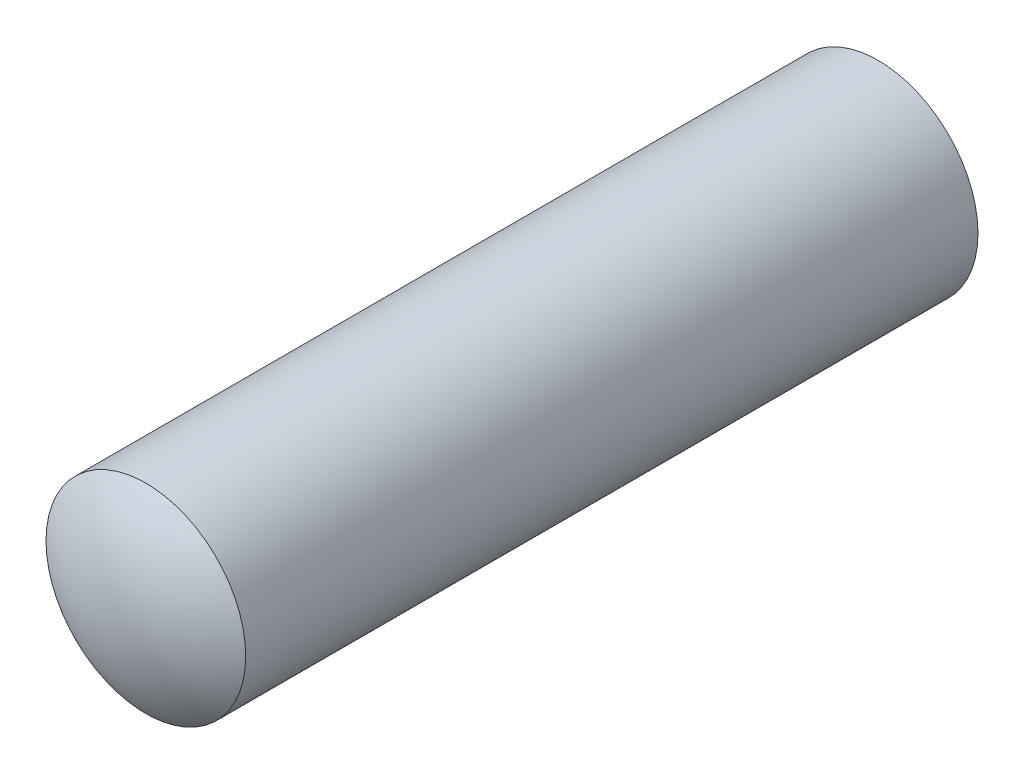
ISO-10303-21;
HEADER;
FILE_DESCRIPTION(('STEP AP214'),'2;1');
FILE_NAME('part.step','',(''),(''),'','','');
FILE_SCHEMA(('AUTOMOTIVE_DESIGN { 1 0 10303 214 1 1 1 1 }'));
ENDSEC;
DATA;
#1=APPLICATION_CONTEXT('core data for automotive mechanical design processes');
#2=APPLICATION_PROTOCOL_DEFINITION('international standard','automotive_design',2000,#1);
#3=PRODUCT_CONTEXT('',#1,'mechanical');
#4=PRODUCT('Part','Part','',(#3));
#5=PRODUCT_RELATED_PRODUCT_CATEGORY('part','',(#4));
#6=PRODUCT_DEFINITION_FORMATION('','',#4);
#7=PRODUCT_DEFINITION_CONTEXT('part definition',#1,'design');
#8=PRODUCT_DEFINITION('design','',#6,#7);
#9=PRODUCT_DEFINITION_SHAPE('','',#8);
#10=(LENGTH_UNIT() NAMED_UNIT(*) SI_UNIT(.MILLI.,.METRE.));
#11=(NAMED_UNIT(*) PLANE_ANGLE_UNIT() SI_UNIT($,.RADIAN.));
#12=(NAMED_UNIT(*) SI_UNIT($,.STERADIAN.) SOLID_ANGLE_UNIT());
#13=UNCERTAINTY_MEASURE_WITH_UNIT(LENGTH_MEASURE(1.E-05),#10,'distance_accuracy_value','');
#14=(GEOMETRIC_REPRESENTATION_CONTEXT(3) GLOBAL_UNCERTAINTY_ASSIGNED_CONTEXT((#13)) GLOBAL_UNIT_ASSIGNED_CONTEXT((#10,
#11,#12)) REPRESENTATION_CONTEXT('',''));
#15=CARTESIAN_POINT('',(0.,0.,0.));
#16=DIRECTION('',(0.,0.,1.));
#17=DIRECTION('',(1.,0.,0.));
#18=AXIS2_PLACEMENT_3D('',#15,#16,#17);
#19=CARTESIAN_POINT('',(0.,0.,11.));
#20=DIRECTION('',(0.,0.,-0.999999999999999));
#21=DIRECTION('',(-1.,0.,0.));
#22=AXIS2_PLACEMENT_3D('',#19,#20,#21);
#23=CYLINDRICAL_SURFACE('',#22,1.5);
#24=CARTESIAN_POINT('',(0.,0.,11.));
#25=DIRECTION('',(0.,0.,0.999999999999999));
#26=DIRECTION('',(1.,0.,0.));
#27=AXIS2_PLACEMENT_3D('',#24,#25,#26);
#28=CIRCLE('',#27,1.5);
#29=CARTESIAN_POINT('',(-1.49999999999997,0.,11.));
#30=VERTEX_POINT('',#29);
#31=EDGE_CURVE('E10',#30,#30,#28,.T.);
#32=CARTESIAN_POINT('',(0.,0.,0.));
#33=DIRECTION('',(0.,0.,0.999999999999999));
#34=DIRECTION('',(1.,0.,0.));
#35=AXIS2_PLACEMENT_3D('',#32,#33,#34);
#36=CIRCLE('',#35,1.5);
#37=CARTESIAN_POINT('',(-1.49999999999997,0.,0.));
#38=VERTEX_POINT('',#37);
#39=EDGE_CURVE('E33',#38,#38,#36,.T.);
#40=CARTESIAN_POINT('',(-1.49999999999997,0.,11.));
#41=CARTESIAN_POINT('',(-1.49999999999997,0.,10.8854166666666));
#42=CARTESIAN_POINT('',(-1.49999999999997,0.,10.7708333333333));
#43=CARTESIAN_POINT('',(-1.49999999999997,0.,10.5416666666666));
#44=CARTESIAN_POINT('',(-1.49999999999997,0.,10.4270833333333));
#45=CARTESIAN_POINT('',(-1.49999999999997,0.,10.1979166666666));
#46=CARTESIAN_POINT('',(-1.49999999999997,0.,10.0833333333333));
#47=CARTESIAN_POINT('',(-1.49999999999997,0.,9.85416666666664));
#48=CARTESIAN_POINT('',(-1.49999999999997,0.,9.7395833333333));
#49=CARTESIAN_POINT('',(-1.49999999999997,0.,9.51041666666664));
#50=CARTESIAN_POINT('',(-1.49999999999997,0.,9.39583333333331));
#51=CARTESIAN_POINT('',(-1.49999999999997,0.,9.16666666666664));
#52=CARTESIAN_POINT('',(-1.49999999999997,0.,9.05208333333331));
#53=CARTESIAN_POINT('',(-1.49999999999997,0.,8.82291666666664));
#54=CARTESIAN_POINT('',(-1.49999999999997,0.,8.70833333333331));
#55=CARTESIAN_POINT('',(-1.49999999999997,0.,8.47916666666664));
#56=CARTESIAN_POINT('',(-1.49999999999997,0.,8.36458333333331));
#57=CARTESIAN_POINT('',(-1.49999999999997,0.,8.13541666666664));
#58=CARTESIAN_POINT('',(-1.49999999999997,0.,8.02083333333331));
#59=CARTESIAN_POINT('',(-1.49999999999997,0.,7.79166666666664));
#60=CARTESIAN_POINT('',(-1.49999999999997,0.,7.67708333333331));
#61=CARTESIAN_POINT('',(-1.49999999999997,0.,7.44791666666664));
#62=CARTESIAN_POINT('',(-1.49999999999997,0.,7.33333333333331));
#63=CARTESIAN_POINT('',(-1.49999999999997,0.,7.10416666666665));
#64=CARTESIAN_POINT('',(-1.49999999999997,0.,6.98958333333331));
#65=CARTESIAN_POINT('',(-1.49999999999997,0.,6.76041666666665));
#66=CARTESIAN_POINT('',(-1.49999999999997,0.,6.64583333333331));
#67=CARTESIAN_POINT('',(-1.49999999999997,0.,6.41666666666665));
#68=CARTESIAN_POINT('',(-1.49999999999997,0.,6.30208333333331));
#69=CARTESIAN_POINT('',(-1.49999999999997,0.,6.07291666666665));
#70=CARTESIAN_POINT('',(-1.49999999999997,0.,5.95833333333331));
#71=CARTESIAN_POINT('',(-1.49999999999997,0.,5.72916666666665));
#72=CARTESIAN_POINT('',(-1.49999999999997,0.,5.61458333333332));
#73=CARTESIAN_POINT('',(-1.49999999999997,0.,5.38541666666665));
#74=CARTESIAN_POINT('',(-1.49999999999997,0.,5.27083333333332));
#75=CARTESIAN_POINT('',(-1.49999999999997,0.,5.04166666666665));
#76=CARTESIAN_POINT('',(-1.49999999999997,0.,4.92708333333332));
#77=CARTESIAN_POINT('',(-1.49999999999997,0.,4.69791666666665));
#78=CARTESIAN_POINT('',(-1.49999999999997,0.,4.58333333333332));
#79=CARTESIAN_POINT('',(-1.49999999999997,0.,4.35416666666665));
#80=CARTESIAN_POINT('',(-1.49999999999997,0.,4.23958333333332));
#81=CARTESIAN_POINT('',(-1.49999999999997,0.,4.01041666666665));
#82=CARTESIAN_POINT('',(-1.49999999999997,0.,3.89583333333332));
#83=CARTESIAN_POINT('',(-1.49999999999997,0.,3.66666666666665));
#84=CARTESIAN_POINT('',(-1.49999999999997,0.,3.55208333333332));
#85=CARTESIAN_POINT('',(-1.49999999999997,0.,3.32291666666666));
#86=CARTESIAN_POINT('',(-1.49999999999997,0.,3.20833333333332));
#87=CARTESIAN_POINT('',(-1.49999999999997,0.,2.97916666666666));
#88=CARTESIAN_POINT('',(-1.49999999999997,0.,2.86458333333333));
#89=CARTESIAN_POINT('',(-1.49999999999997,0.,2.63541666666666));
#90=CARTESIAN_POINT('',(-1.49999999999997,0.,2.52083333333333));
#91=CARTESIAN_POINT('',(-1.49999999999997,0.,2.29166666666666));
#92=CARTESIAN_POINT('',(-1.49999999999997,0.,2.17708333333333));
#93=CARTESIAN_POINT('',(-1.49999999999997,0.,1.94791666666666));
#94=CARTESIAN_POINT('',(-1.49999999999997,0.,1.83333333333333));
#95=CARTESIAN_POINT('',(-1.49999999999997,0.,1.60416666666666));
#96=CARTESIAN_POINT('',(-1.49999999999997,0.,1.48958333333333));
#97=CARTESIAN_POINT('',(-1.49999999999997,0.,1.26041666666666));
#98=CARTESIAN_POINT('',(-1.49999999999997,0.,1.14583333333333));
#99=CARTESIAN_POINT('',(-1.49999999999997,0.,0.916666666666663));
#100=CARTESIAN_POINT('',(-1.49999999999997,0.,0.80208333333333));
#101=CARTESIAN_POINT('',(-1.49999999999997,0.,0.572916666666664));
#102=CARTESIAN_POINT('',(-1.49999999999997,0.,0.45833333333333));
#103=CARTESIAN_POINT('',(-1.49999999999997,0.,0.229166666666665));
#104=CARTESIAN_POINT('',(-1.49999999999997,0.,0.114583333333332));
#105=CARTESIAN_POINT('',(-1.49999999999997,0.,0.));
#106=B_SPLINE_CURVE_WITH_KNOTS('',3,(#40,#41,#42,#43,#44,#45,#46,#47,#48,#49,#50,#51,#52,#53,
#54,#55,#56,#57,#58,#59,#60,#61,#62,#63,#64,#65,#66,#67,#68,#69,#70,#71,#72,#73,#74,#75,#76,#77,
#78,#79,#80,#81,#82,#83,#84,#85,#86,#87,#88,#89,#90,#91,#92,#93,#94,#95,#96,#97,#98,#99,#100,
#101,#102,#103,#104,#105),.UNSPECIFIED.,.F.,.F.,(4,2,2,2,2,2,2,2,2,2,2,2,2,2,2,2,2,2,2,2,2,2,2,
2,2,2,2,2,2,2,2,2,4),(0.,0.34375,0.687499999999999,1.03125,1.375,1.71875,2.06249999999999,
2.40624999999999,2.74999999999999,3.09374999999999,3.43749999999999,3.78124999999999,
4.12499999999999,4.46874999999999,4.81249999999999,5.15624999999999,5.49999999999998,
5.84374999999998,6.18749999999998,6.53124999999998,6.87499999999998,7.21874999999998,
7.56249999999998,7.90624999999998,8.24999999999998,8.59374999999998,8.93749999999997,
9.28124999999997,9.62499999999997,9.96874999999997,10.3125,10.65625,11.),.UNSPECIFIED.);
#107=EDGE_CURVE('BSEAM26',#30,#38,#106,.T.);
#108=ORIENTED_EDGE('',*,*,#31,.F.);
#109=ORIENTED_EDGE('',*,*,#39,.T.);
#110=ORIENTED_EDGE('',*,*,#107,.T.);
#111=ORIENTED_EDGE('',*,*,#107,.F.);
#112=EDGE_LOOP('',(#108,#110,#109,#111));
#113=FACE_BOUND('',#112,.T.);
#114=ADVANCED_FACE('F26',(#113),#23,.T.);
#115=CARTESIAN_POINT('',(0.,0.,8.99999999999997));
#116=DIRECTION('',(0.,0.,0.999999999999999));
#117=DIRECTION('',(1.,0.,0.));
#118=AXIS2_PLACEMENT_3D('',#115,#116,#117);
#119=SPHERICAL_SURFACE('',#118,2.5);
#120=ORIENTED_EDGE('',*,*,#31,.T.);
#121=EDGE_LOOP('',(#120));
#122=FACE_BOUND('',#121,.T.);
#123=ADVANCED_FACE('F41',(#122),#119,.T.);
#124=CARTESIAN_POINT('',(0.,0.,2.));
#125=DIRECTION('',(0.,0.,0.999999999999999));
#126=DIRECTION('',(1.,0.,0.));
#127=AXIS2_PLACEMENT_3D('',#124,#125,#126);
#128=SPHERICAL_SURFACE('',#127,2.5);
#129=ORIENTED_EDGE('',*,*,#39,.F.);
#130=EDGE_LOOP('',(#129));
#131=FACE_BOUND('',#130,.T.);
#132=ADVANCED_FACE('F28',(#131),#128,.T.);
#133=CLOSED_SHELL('',(#114,#123,#132));
#134=MANIFOLD_SOLID_BREP('B2',#133);
#135=ADVANCED_BREP_SHAPE_REPRESENTATION('',(#18,#134),#14);
#136=SHAPE_DEFINITION_REPRESENTATION(#9,#135);
ENDSEC;
END-ISO-10303-21;
